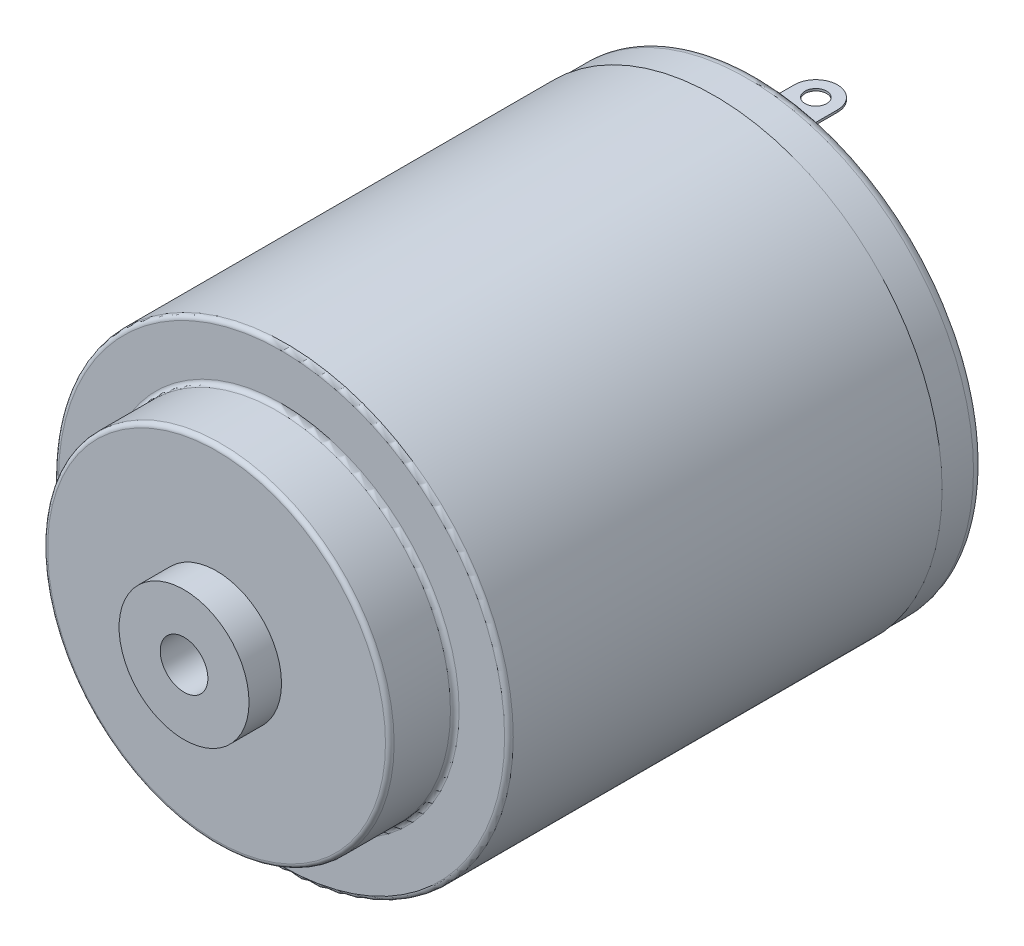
ISO-10303-21;
HEADER;
FILE_DESCRIPTION(('STEP AP214'),'2;1');
FILE_NAME('part.step','',(''),(''),'','','');
FILE_SCHEMA(('AUTOMOTIVE_DESIGN { 1 0 10303 214 1 1 1 1 }'));
ENDSEC;
DATA;
#1=APPLICATION_CONTEXT('core data for automotive mechanical design processes');
#2=APPLICATION_PROTOCOL_DEFINITION('international standard','automotive_design',2000,#1);
#3=PRODUCT_CONTEXT('',#1,'mechanical');
#4=PRODUCT('Part','Part','',(#3));
#5=PRODUCT_RELATED_PRODUCT_CATEGORY('part','',(#4));
#6=PRODUCT_DEFINITION_FORMATION('','',#4);
#7=PRODUCT_DEFINITION_CONTEXT('part definition',#1,'design');
#8=PRODUCT_DEFINITION('design','',#6,#7);
#9=PRODUCT_DEFINITION_SHAPE('','',#8);
#10=(LENGTH_UNIT() NAMED_UNIT(*) SI_UNIT(.MILLI.,.METRE.));
#11=(NAMED_UNIT(*) PLANE_ANGLE_UNIT() SI_UNIT($,.RADIAN.));
#12=(NAMED_UNIT(*) SI_UNIT($,.STERADIAN.) SOLID_ANGLE_UNIT());
#13=UNCERTAINTY_MEASURE_WITH_UNIT(LENGTH_MEASURE(1.E-05),#10,'distance_accuracy_value','');
#14=(GEOMETRIC_REPRESENTATION_CONTEXT(3) GLOBAL_UNCERTAINTY_ASSIGNED_CONTEXT((#13)) GLOBAL_UNIT_ASSIGNED_CONTEXT((#10,
#11,#12)) REPRESENTATION_CONTEXT('',''));
#15=CARTESIAN_POINT('',(0.,0.,0.));
#16=DIRECTION('',(0.,0.,1.));
#17=DIRECTION('',(1.,0.,0.));
#18=AXIS2_PLACEMENT_3D('',#15,#16,#17);
#19=CARTESIAN_POINT('',(0.,0.,-2.));
#20=DIRECTION('',(0.,0.,-1.));
#21=DIRECTION('',(-1.,0.,0.));
#22=AXIS2_PLACEMENT_3D('',#19,#20,#21);
#23=PLANE('',#22);
#24=DIRECTION('',(1.,0.,0.));
#25=VECTOR('',#24,1.);
#26=CARTESIAN_POINT('',(1.91816391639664,2.30665281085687,-2.));
#27=LINE('',#26,#25);
#28=CARTESIAN_POINT('',(-1.91816391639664,2.30665281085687,-2.));
#29=VERTEX_POINT('',#28);
#30=CARTESIAN_POINT('',(1.91816391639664,2.30665281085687,-2.));
#31=VERTEX_POINT('',#30);
#32=EDGE_CURVE('E233',#29,#31,#27,.T.);
#33=ORIENTED_EDGE('',*,*,#32,.F.);
#34=CARTESIAN_POINT('',(0.,0.,-2.));
#35=DIRECTION('',(0.,0.,-1.));
#36=DIRECTION('',(-1.,0.,0.));
#37=AXIS2_PLACEMENT_3D('',#34,#35,#36);
#38=CIRCLE('',#37,3.);
#39=EDGE_CURVE('E231',#31,#29,#38,.T.);
#40=ORIENTED_EDGE('',*,*,#39,.F.);
#41=EDGE_LOOP('',(#33,#40));
#42=FACE_BOUND('',#41,.T.);
#43=CARTESIAN_POINT('',(0.,0.,-2.));
#44=DIRECTION('',(0.,0.,-1.));
#45=DIRECTION('',(-1.,0.,0.));
#46=AXIS2_PLACEMENT_3D('',#43,#44,#45);
#47=CIRCLE('',#46,6.5);
#48=CARTESIAN_POINT('',(-1.75000000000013,-6.25999201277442,-2.));
#49=VERTEX_POINT('',#48);
#50=CARTESIAN_POINT('',(-1.75000000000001,6.25999201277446,-2.));
#51=VERTEX_POINT('',#50);
#52=EDGE_CURVE('E246',#49,#51,#47,.T.);
#53=ORIENTED_EDGE('',*,*,#52,.F.);
#54=DIRECTION('',(0.,-1.,0.));
#55=VECTOR('',#54,1.);
#56=CARTESIAN_POINT('',(-1.74999999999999,-3.03108891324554,-2.));
#57=LINE('',#56,#55);
#58=CARTESIAN_POINT('',(-1.74999999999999,-3.03108891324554,-2.));
#59=VERTEX_POINT('',#58);
#60=EDGE_CURVE('E254',#59,#49,#57,.T.);
#61=ORIENTED_EDGE('',*,*,#60,.F.);
#62=CARTESIAN_POINT('',(0.,0.,-2.));
#63=DIRECTION('',(0.,0.,1.));
#64=DIRECTION('',(-1.,0.,0.));
#65=AXIS2_PLACEMENT_3D('',#62,#63,#64);
#66=CIRCLE('',#65,3.5);
#67=CARTESIAN_POINT('',(-1.74999999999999,3.03108891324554,-2.));
#68=VERTEX_POINT('',#67);
#69=EDGE_CURVE('E251',#68,#59,#66,.T.);
#70=ORIENTED_EDGE('',*,*,#69,.F.);
#71=DIRECTION('',(0.,-1.,0.));
#72=VECTOR('',#71,1.);
#73=CARTESIAN_POINT('',(-1.75000000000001,6.25999201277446,-2.));
#74=LINE('',#73,#72);
#75=EDGE_CURVE('E248',#51,#68,#74,.T.);
#76=ORIENTED_EDGE('',*,*,#75,.F.);
#77=EDGE_LOOP('',(#53,#61,#70,#76));
#78=FACE_BOUND('',#77,.T.);
#79=CARTESIAN_POINT('',(0.,0.,-2.));
#80=DIRECTION('',(0.,0.,1.));
#81=DIRECTION('',(-1.,0.,0.));
#82=AXIS2_PLACEMENT_3D('',#79,#80,#81);
#83=CIRCLE('',#82,3.5);
#84=CARTESIAN_POINT('',(1.75,-3.03108891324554,-2.));
#85=VERTEX_POINT('',#84);
#86=CARTESIAN_POINT('',(1.75,3.03108891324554,-2.));
#87=VERTEX_POINT('',#86);
#88=EDGE_CURVE('E272',#85,#87,#83,.T.);
#89=ORIENTED_EDGE('',*,*,#88,.F.);
#90=DIRECTION('',(0.,1.,0.));
#91=VECTOR('',#90,1.);
#92=CARTESIAN_POINT('',(1.75,-3.03108891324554,-2.));
#93=LINE('',#92,#91);
#94=CARTESIAN_POINT('',(1.75,-6.25999201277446,-2.));
#95=VERTEX_POINT('',#94);
#96=EDGE_CURVE('E286',#95,#85,#93,.T.);
#97=ORIENTED_EDGE('',*,*,#96,.F.);
#98=CARTESIAN_POINT('',(0.,0.,-2.));
#99=DIRECTION('',(0.,0.,-1.));
#100=DIRECTION('',(-1.,0.,0.));
#101=AXIS2_PLACEMENT_3D('',#98,#99,#100);
#102=CIRCLE('',#101,6.5);
#103=CARTESIAN_POINT('',(1.75,6.25999201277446,-2.));
#104=VERTEX_POINT('',#103);
#105=EDGE_CURVE('E283',#104,#95,#102,.T.);
#106=ORIENTED_EDGE('',*,*,#105,.F.);
#107=DIRECTION('',(0.,1.,0.));
#108=VECTOR('',#107,1.);
#109=CARTESIAN_POINT('',(1.75,3.03108891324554,-2.));
#110=LINE('',#109,#108);
#111=EDGE_CURVE('E280',#87,#104,#110,.T.);
#112=ORIENTED_EDGE('',*,*,#111,.F.);
#113=EDGE_LOOP('',(#89,#97,#106,#112));
#114=FACE_BOUND('',#113,.T.);
#115=CARTESIAN_POINT('',(0.,0.,-2.));
#116=DIRECTION('',(0.,0.,-1.));
#117=DIRECTION('',(-1.,0.,0.));
#118=AXIS2_PLACEMENT_3D('',#115,#116,#117);
#119=CIRCLE('',#118,9.95);
#120=CARTESIAN_POINT('',(-9.95,0.,-2.));
#121=VERTEX_POINT('',#120);
#122=EDGE_CURVE('E340',#121,#121,#119,.T.);
#123=ORIENTED_EDGE('',*,*,#122,.T.);
#124=EDGE_LOOP('',(#123));
#125=FACE_BOUND('',#124,.T.);
#126=DIRECTION('',(1.,0.,0.));
#127=VECTOR('',#126,1.);
#128=CARTESIAN_POINT('',(0.,8.1,-2.));
#129=LINE('',#128,#127);
#130=CARTESIAN_POINT('',(-1.,8.1,-2.));
#131=VERTEX_POINT('',#130);
#132=CARTESIAN_POINT('',(0.999999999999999,8.1,-2.));
#133=VERTEX_POINT('',#132);
#134=EDGE_CURVE('E13',#131,#133,#129,.T.);
#135=ORIENTED_EDGE('',*,*,#134,.F.);
#136=DIRECTION('',(0.,-1.,0.));
#137=VECTOR('',#136,1.);
#138=CARTESIAN_POINT('',(-1.,0.,-2.));
#139=LINE('',#138,#137);
#140=CARTESIAN_POINT('',(-1.,8.,-2.));
#141=VERTEX_POINT('',#140);
#142=EDGE_CURVE('E349',#131,#141,#139,.T.);
#143=ORIENTED_EDGE('',*,*,#142,.T.);
#144=DIRECTION('',(1.,0.,0.));
#145=VECTOR('',#144,1.);
#146=CARTESIAN_POINT('',(0.,8.,-2.));
#147=LINE('',#146,#145);
#148=CARTESIAN_POINT('',(0.999999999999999,8.,-2.));
#149=VERTEX_POINT('',#148);
#150=EDGE_CURVE('E346',#141,#149,#147,.T.);
#151=ORIENTED_EDGE('',*,*,#150,.T.);
#152=DIRECTION('',(0.,1.,0.));
#153=VECTOR('',#152,1.);
#154=CARTESIAN_POINT('',(0.999999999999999,0.,-2.));
#155=LINE('',#154,#153);
#156=EDGE_CURVE('E47',#149,#133,#155,.T.);
#157=ORIENTED_EDGE('',*,*,#156,.T.);
#158=EDGE_LOOP('',(#135,#143,#151,#157));
#159=FACE_BOUND('',#158,.T.);
#160=DIRECTION('',(0.,-1.,0.));
#161=VECTOR('',#160,1.);
#162=CARTESIAN_POINT('',(0.999999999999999,-7.9,-2.));
#163=LINE('',#162,#161);
#164=CARTESIAN_POINT('',(0.999999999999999,-7.9,-2.));
#165=VERTEX_POINT('',#164);
#166=CARTESIAN_POINT('',(0.999999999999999,-8.,-2.));
#167=VERTEX_POINT('',#166);
#168=EDGE_CURVE('E60',#165,#167,#163,.T.);
#169=ORIENTED_EDGE('',*,*,#168,.F.);
#170=DIRECTION('',(1.,0.,0.));
#171=VECTOR('',#170,1.);
#172=CARTESIAN_POINT('',(-0.999999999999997,-7.9,-2.));
#173=LINE('',#172,#171);
#174=CARTESIAN_POINT('',(-0.999999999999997,-7.9,-2.));
#175=VERTEX_POINT('',#174);
#176=EDGE_CURVE('E55',#175,#165,#173,.T.);
#177=ORIENTED_EDGE('',*,*,#176,.F.);
#178=DIRECTION('',(0.,-1.,0.));
#179=VECTOR('',#178,1.);
#180=CARTESIAN_POINT('',(-0.999999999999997,-7.9,-2.));
#181=LINE('',#180,#179);
#182=CARTESIAN_POINT('',(-0.999999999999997,-8.,-2.));
#183=VERTEX_POINT('',#182);
#184=EDGE_CURVE('E160',#175,#183,#181,.T.);
#185=ORIENTED_EDGE('',*,*,#184,.T.);
#186=DIRECTION('',(1.,0.,0.));
#187=VECTOR('',#186,1.);
#188=CARTESIAN_POINT('',(-0.999999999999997,-8.,-2.));
#189=LINE('',#188,#187);
#190=EDGE_CURVE('E162',#183,#167,#189,.T.);
#191=ORIENTED_EDGE('',*,*,#190,.T.);
#192=EDGE_LOOP('',(#169,#177,#185,#191));
#193=FACE_BOUND('',#192,.T.);
#194=ADVANCED_FACE('F38',(#42,#78,#114,#125,#159,#193),#23,.T.);
#195=CARTESIAN_POINT('',(0.,0.,0.));
#196=DIRECTION('',(0.,0.,1.));
#197=DIRECTION('',(1.,0.,0.));
#198=AXIS2_PLACEMENT_3D('',#195,#196,#197);
#199=PLANE('',#198);
#200=CARTESIAN_POINT('',(0.,0.,0.));
#201=DIRECTION('',(0.,0.,1.));
#202=DIRECTION('',(1.,0.,0.));
#203=AXIS2_PLACEMENT_3D('',#200,#201,#202);
#204=CIRCLE('',#203,10.5);
#205=CARTESIAN_POINT('',(10.5,0.,0.));
#206=VERTEX_POINT('',#205);
#207=EDGE_CURVE('E316',#206,#206,#204,.T.);
#208=ORIENTED_EDGE('',*,*,#207,.F.);
#209=EDGE_LOOP('',(#208));
#210=FACE_BOUND('',#209,.T.);
#211=CARTESIAN_POINT('',(0.,0.,0.));
#212=DIRECTION('',(0.,0.,1.));
#213=DIRECTION('',(1.,0.,0.));
#214=AXIS2_PLACEMENT_3D('',#211,#212,#213);
#215=CIRCLE('',#214,10.45);
#216=CARTESIAN_POINT('',(10.45,0.,0.));
#217=VERTEX_POINT('',#216);
#218=EDGE_CURVE('E337',#217,#217,#215,.F.);
#219=ORIENTED_EDGE('',*,*,#218,.F.);
#220=EDGE_LOOP('',(#219));
#221=FACE_BOUND('',#220,.T.);
#222=ADVANCED_FACE('F372',(#210,#221),#199,.F.);
#223=CARTESIAN_POINT('',(0.,0.,23.));
#224=DIRECTION('',(0.,0.,1.));
#225=DIRECTION('',(1.,0.,0.));
#226=AXIS2_PLACEMENT_3D('',#223,#224,#225);
#227=PLANE('',#226);
#228=CARTESIAN_POINT('',(0.,0.,23.));
#229=DIRECTION('',(0.,0.,1.));
#230=DIRECTION('',(1.,0.,0.));
#231=AXIS2_PLACEMENT_3D('',#228,#229,#230);
#232=CIRCLE('',#231,7.8);
#233=CARTESIAN_POINT('',(7.8,0.,23.));
#234=VERTEX_POINT('',#233);
#235=EDGE_CURVE('E331',#234,#234,#232,.T.);
#236=ORIENTED_EDGE('',*,*,#235,.T.);
#237=EDGE_LOOP('',(#236));
#238=FACE_BOUND('',#237,.T.);
#239=CARTESIAN_POINT('',(0.,0.,23.));
#240=DIRECTION('',(0.,0.,1.));
#241=DIRECTION('',(1.,0.,0.));
#242=AXIS2_PLACEMENT_3D('',#239,#240,#241);
#243=CIRCLE('',#242,3.);
#244=CARTESIAN_POINT('',(3.,0.,23.));
#245=VERTEX_POINT('',#244);
#246=EDGE_CURVE('E304',#245,#245,#243,.T.);
#247=ORIENTED_EDGE('',*,*,#246,.F.);
#248=EDGE_LOOP('',(#247));
#249=FACE_BOUND('',#248,.T.);
#250=ADVANCED_FACE('F378',(#238,#249),#227,.T.);
#251=CARTESIAN_POINT('',(0.,0.,20.));
#252=DIRECTION('',(0.,0.,1.));
#253=DIRECTION('',(1.,0.,0.));
#254=AXIS2_PLACEMENT_3D('',#251,#252,#253);
#255=PLANE('',#254);
#256=CARTESIAN_POINT('',(0.,0.,20.));
#257=DIRECTION('',(0.,0.,1.));
#258=DIRECTION('',(1.,0.,0.));
#259=AXIS2_PLACEMENT_3D('',#256,#257,#258);
#260=CIRCLE('',#259,8.2);
#261=CARTESIAN_POINT('',(8.2,0.,20.));
#262=VERTEX_POINT('',#261);
#263=EDGE_CURVE('E328',#262,#262,#260,.F.);
#264=ORIENTED_EDGE('',*,*,#263,.T.);
#265=EDGE_LOOP('',(#264));
#266=FACE_BOUND('',#265,.T.);
#267=CARTESIAN_POINT('',(0.,0.,20.));
#268=DIRECTION('',(0.,0.,1.));
#269=DIRECTION('',(1.,0.,0.));
#270=AXIS2_PLACEMENT_3D('',#267,#268,#269);
#271=CIRCLE('',#270,10.3);
#272=CARTESIAN_POINT('',(10.3,0.,20.));
#273=VERTEX_POINT('',#272);
#274=EDGE_CURVE('E325',#273,#273,#271,.T.);
#275=ORIENTED_EDGE('',*,*,#274,.T.);
#276=EDGE_LOOP('',(#275));
#277=FACE_BOUND('',#276,.T.);
#278=ADVANCED_FACE('F414',(#266,#277),#255,.T.);
#279=CARTESIAN_POINT('',(0.,0.,20.));
#280=DIRECTION('',(0.,0.,-1.));
#281=DIRECTION('',(-1.,0.,0.));
#282=AXIS2_PLACEMENT_3D('',#279,#280,#281);
#283=CYLINDRICAL_SURFACE('',#282,10.5);
#284=CARTESIAN_POINT('',(0.,0.,19.8));
#285=DIRECTION('',(0.,0.,1.));
#286=DIRECTION('',(1.,0.,0.));
#287=AXIS2_PLACEMENT_3D('',#284,#285,#286);
#288=CIRCLE('',#287,10.5);
#289=CARTESIAN_POINT('',(10.5,0.,19.8));
#290=VERTEX_POINT('',#289);
#291=EDGE_CURVE('E334',#290,#290,#288,.F.);
#292=ORIENTED_EDGE('',*,*,#291,.T.);
#293=EDGE_LOOP('',(#292));
#294=FACE_BOUND('',#293,.T.);
#295=ORIENTED_EDGE('',*,*,#207,.T.);
#296=EDGE_LOOP('',(#295));
#297=FACE_BOUND('',#296,.T.);
#298=ADVANCED_FACE('F40',(#294,#297),#283,.T.);
#299=CARTESIAN_POINT('',(0.,0.,23.));
#300=DIRECTION('',(0.,0.,-1.));
#301=DIRECTION('',(-1.,0.,0.));
#302=AXIS2_PLACEMENT_3D('',#299,#300,#301);
#303=CYLINDRICAL_SURFACE('',#302,8.);
#304=CARTESIAN_POINT('',(0.,0.,20.2));
#305=DIRECTION('',(0.,0.,1.));
#306=DIRECTION('',(1.,0.,0.));
#307=AXIS2_PLACEMENT_3D('',#304,#305,#306);
#308=CIRCLE('',#307,8.);
#309=CARTESIAN_POINT('',(8.,0.,20.2));
#310=VERTEX_POINT('',#309);
#311=EDGE_CURVE('E322',#310,#310,#308,.T.);
#312=ORIENTED_EDGE('',*,*,#311,.T.);
#313=EDGE_LOOP('',(#312));
#314=FACE_BOUND('',#313,.T.);
#315=CARTESIAN_POINT('',(0.,0.,22.8));
#316=DIRECTION('',(0.,0.,1.));
#317=DIRECTION('',(1.,0.,0.));
#318=AXIS2_PLACEMENT_3D('',#315,#316,#317);
#319=CIRCLE('',#318,8.);
#320=CARTESIAN_POINT('',(8.,0.,22.8));
#321=VERTEX_POINT('',#320);
#322=EDGE_CURVE('E319',#321,#321,#319,.F.);
#323=ORIENTED_EDGE('',*,*,#322,.T.);
#324=EDGE_LOOP('',(#323));
#325=FACE_BOUND('',#324,.T.);
#326=ADVANCED_FACE('F410',(#314,#325),#303,.T.);
#327=CARTESIAN_POINT('',(0.,0.,24.5));
#328=DIRECTION('',(0.,0.,-1.));
#329=DIRECTION('',(-1.,0.,0.));
#330=AXIS2_PLACEMENT_3D('',#327,#328,#329);
#331=CYLINDRICAL_SURFACE('',#330,3.);
#332=CARTESIAN_POINT('',(0.,0.,24.5));
#333=DIRECTION('',(0.,0.,1.));
#334=DIRECTION('',(1.,0.,0.));
#335=AXIS2_PLACEMENT_3D('',#332,#333,#334);
#336=CIRCLE('',#335,3.);
#337=CARTESIAN_POINT('',(3.,0.,24.5));
#338=VERTEX_POINT('',#337);
#339=EDGE_CURVE('E313',#338,#338,#336,.T.);
#340=ORIENTED_EDGE('',*,*,#339,.F.);
#341=EDGE_LOOP('',(#340));
#342=FACE_BOUND('',#341,.T.);
#343=ORIENTED_EDGE('',*,*,#246,.T.);
#344=EDGE_LOOP('',(#343));
#345=FACE_BOUND('',#344,.T.);
#346=ADVANCED_FACE('F406',(#342,#345),#331,.T.);
#347=CARTESIAN_POINT('',(0.,0.,24.5));
#348=DIRECTION('',(0.,0.,1.));
#349=DIRECTION('',(1.,0.,0.));
#350=AXIS2_PLACEMENT_3D('',#347,#348,#349);
#351=PLANE('',#350);
#352=CARTESIAN_POINT('',(0.,0.,24.5));
#353=DIRECTION('',(0.,0.,1.));
#354=DIRECTION('',(1.,0.,0.));
#355=AXIS2_PLACEMENT_3D('',#352,#353,#354);
#356=CIRCLE('',#355,1.1);
#357=CARTESIAN_POINT('',(1.1,0.,24.5));
#358=VERTEX_POINT('',#357);
#359=EDGE_CURVE('E708',#358,#358,#356,.T.);
#360=ORIENTED_EDGE('',*,*,#359,.F.);
#361=EDGE_LOOP('',(#360));
#362=FACE_BOUND('',#361,.T.);
#363=ORIENTED_EDGE('',*,*,#339,.T.);
#364=EDGE_LOOP('',(#363));
#365=FACE_BOUND('',#364,.T.);
#366=ADVANCED_FACE('F402',(#362,#365),#351,.T.);
#367=CARTESIAN_POINT('',(0.,0.,20.2));
#368=DIRECTION('',(0.,0.,1.));
#369=DIRECTION('',(1.,0.,0.));
#370=AXIS2_PLACEMENT_3D('',#367,#368,#369);
#371=TOROIDAL_SURFACE('',#370,8.2,0.2);
#372=ORIENTED_EDGE('',*,*,#263,.F.);
#373=EDGE_LOOP('',(#372));
#374=FACE_BOUND('',#373,.T.);
#375=ORIENTED_EDGE('',*,*,#311,.F.);
#376=EDGE_LOOP('',(#375));
#377=FACE_BOUND('',#376,.T.);
#378=ADVANCED_FACE('F398',(#374,#377),#371,.F.);
#379=CARTESIAN_POINT('',(0.,0.,22.8));
#380=DIRECTION('',(0.,0.,1.));
#381=DIRECTION('',(1.,0.,0.));
#382=AXIS2_PLACEMENT_3D('',#379,#380,#381);
#383=TOROIDAL_SURFACE('',#382,7.8,0.2);
#384=ORIENTED_EDGE('',*,*,#322,.F.);
#385=EDGE_LOOP('',(#384));
#386=FACE_BOUND('',#385,.T.);
#387=ORIENTED_EDGE('',*,*,#235,.F.);
#388=EDGE_LOOP('',(#387));
#389=FACE_BOUND('',#388,.T.);
#390=ADVANCED_FACE('F394',(#386,#389),#383,.T.);
#391=CARTESIAN_POINT('',(0.,0.,19.8));
#392=DIRECTION('',(0.,0.,1.));
#393=DIRECTION('',(1.,0.,0.));
#394=AXIS2_PLACEMENT_3D('',#391,#392,#393);
#395=TOROIDAL_SURFACE('',#394,10.3,0.2);
#396=ORIENTED_EDGE('',*,*,#291,.F.);
#397=EDGE_LOOP('',(#396));
#398=FACE_BOUND('',#397,.T.);
#399=ORIENTED_EDGE('',*,*,#274,.F.);
#400=EDGE_LOOP('',(#399));
#401=FACE_BOUND('',#400,.T.);
#402=ADVANCED_FACE('F390',(#398,#401),#395,.T.);
#403=CARTESIAN_POINT('',(0.,0.,-2.));
#404=DIRECTION('',(0.,0.,1.));
#405=DIRECTION('',(1.,0.,0.));
#406=AXIS2_PLACEMENT_3D('',#403,#404,#405);
#407=CYLINDRICAL_SURFACE('',#406,10.45);
#408=CARTESIAN_POINT('',(0.,0.,-1.5));
#409=DIRECTION('',(0.,0.,-1.));
#410=DIRECTION('',(-1.,0.,0.));
#411=AXIS2_PLACEMENT_3D('',#408,#409,#410);
#412=CIRCLE('',#411,10.45);
#413=CARTESIAN_POINT('',(-10.45,0.,-1.5));
#414=VERTEX_POINT('',#413);
#415=EDGE_CURVE('E343',#414,#414,#412,.F.);
#416=ORIENTED_EDGE('',*,*,#415,.T.);
#417=EDGE_LOOP('',(#416));
#418=FACE_BOUND('',#417,.T.);
#419=ORIENTED_EDGE('',*,*,#218,.T.);
#420=EDGE_LOOP('',(#419));
#421=FACE_BOUND('',#420,.T.);
#422=ADVANCED_FACE('F387',(#418,#421),#407,.T.);
#423=CARTESIAN_POINT('',(0.,0.,-1.5));
#424=DIRECTION('',(0.,0.,-1.));
#425=DIRECTION('',(-1.,0.,0.));
#426=AXIS2_PLACEMENT_3D('',#423,#424,#425);
#427=TOROIDAL_SURFACE('',#426,9.95,0.5);
#428=ORIENTED_EDGE('',*,*,#415,.F.);
#429=EDGE_LOOP('',(#428));
#430=FACE_BOUND('',#429,.T.);
#431=ORIENTED_EDGE('',*,*,#122,.F.);
#432=EDGE_LOOP('',(#431));
#433=FACE_BOUND('',#432,.T.);
#434=ADVANCED_FACE('F385',(#430,#433),#427,.T.);
#435=CARTESIAN_POINT('',(0.,0.,-1.5));
#436=DIRECTION('',(0.,0.,-1.));
#437=DIRECTION('',(-1.,0.,0.));
#438=AXIS2_PLACEMENT_3D('',#435,#436,#437);
#439=CYLINDRICAL_SURFACE('',#438,3.5);
#440=ORIENTED_EDGE('',*,*,#88,.T.);
#441=DIRECTION('',(0.,0.,-1.));
#442=VECTOR('',#441,1.);
#443=CARTESIAN_POINT('',(1.75,3.03108891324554,-1.5));
#444=LINE('',#443,#442);
#445=CARTESIAN_POINT('',(1.75,3.03108891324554,-1.5));
#446=VERTEX_POINT('',#445);
#447=EDGE_CURVE('E301',#446,#87,#444,.T.);
#448=ORIENTED_EDGE('',*,*,#447,.F.);
#449=CARTESIAN_POINT('',(0.,0.,-1.5));
#450=DIRECTION('',(0.,0.,1.));
#451=DIRECTION('',(-1.,0.,0.));
#452=AXIS2_PLACEMENT_3D('',#449,#450,#451);
#453=CIRCLE('',#452,3.5);
#454=CARTESIAN_POINT('',(1.75,-3.03108891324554,-1.5));
#455=VERTEX_POINT('',#454);
#456=EDGE_CURVE('E289',#455,#446,#453,.T.);
#457=ORIENTED_EDGE('',*,*,#456,.F.);
#458=DIRECTION('',(0.,0.,-1.));
#459=VECTOR('',#458,1.);
#460=CARTESIAN_POINT('',(1.75,-3.03108891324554,-1.5));
#461=LINE('',#460,#459);
#462=EDGE_CURVE('E302',#455,#85,#461,.T.);
#463=ORIENTED_EDGE('',*,*,#462,.T.);
#464=EDGE_LOOP('',(#440,#448,#457,#463));
#465=FACE_BOUND('',#464,.T.);
#466=ADVANCED_FACE('F477',(#465),#439,.T.);
#467=CARTESIAN_POINT('',(1.75,-3.03108891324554,-1.5));
#468=DIRECTION('',(-1.,0.,0.));
#469=DIRECTION('',(0.,0.,1.));
#470=AXIS2_PLACEMENT_3D('',#467,#468,#469);
#471=PLANE('',#470);
#472=ORIENTED_EDGE('',*,*,#96,.T.);
#473=ORIENTED_EDGE('',*,*,#462,.F.);
#474=DIRECTION('',(0.,1.,0.));
#475=VECTOR('',#474,1.);
#476=CARTESIAN_POINT('',(1.75,-3.03108891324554,-1.5));
#477=LINE('',#476,#475);
#478=CARTESIAN_POINT('',(1.75,-6.25999201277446,-1.5));
#479=VERTEX_POINT('',#478);
#480=EDGE_CURVE('E298',#479,#455,#477,.T.);
#481=ORIENTED_EDGE('',*,*,#480,.F.);
#482=DIRECTION('',(0.,0.,-1.));
#483=VECTOR('',#482,1.);
#484=CARTESIAN_POINT('',(1.75,-6.25999201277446,-1.5));
#485=LINE('',#484,#483);
#486=EDGE_CURVE('E305',#479,#95,#485,.T.);
#487=ORIENTED_EDGE('',*,*,#486,.T.);
#488=EDGE_LOOP('',(#472,#473,#481,#487));
#489=FACE_BOUND('',#488,.T.);
#490=ADVANCED_FACE('F484',(#489),#471,.F.);
#491=CARTESIAN_POINT('',(0.,0.,-1.5));
#492=DIRECTION('',(0.,0.,-1.));
#493=DIRECTION('',(-1.,0.,0.));
#494=AXIS2_PLACEMENT_3D('',#491,#492,#493);
#495=CYLINDRICAL_SURFACE('',#494,6.5);
#496=ORIENTED_EDGE('',*,*,#105,.T.);
#497=ORIENTED_EDGE('',*,*,#486,.F.);
#498=CARTESIAN_POINT('',(0.,0.,-1.5));
#499=DIRECTION('',(0.,0.,-1.));
#500=DIRECTION('',(-1.,0.,0.));
#501=AXIS2_PLACEMENT_3D('',#498,#499,#500);
#502=CIRCLE('',#501,6.5);
#503=CARTESIAN_POINT('',(1.75,6.25999201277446,-1.5));
#504=VERTEX_POINT('',#503);
#505=EDGE_CURVE('E295',#504,#479,#502,.T.);
#506=ORIENTED_EDGE('',*,*,#505,.F.);
#507=DIRECTION('',(0.,0.,-1.));
#508=VECTOR('',#507,1.);
#509=CARTESIAN_POINT('',(1.75,6.25999201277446,-1.5));
#510=LINE('',#509,#508);
#511=EDGE_CURVE('E307',#504,#104,#510,.T.);
#512=ORIENTED_EDGE('',*,*,#511,.T.);
#513=EDGE_LOOP('',(#496,#497,#506,#512));
#514=FACE_BOUND('',#513,.T.);
#515=ADVANCED_FACE('F491',(#514),#495,.F.);
#516=CARTESIAN_POINT('',(1.75,3.03108891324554,-1.5));
#517=DIRECTION('',(-1.,0.,0.));
#518=DIRECTION('',(0.,0.,1.));
#519=AXIS2_PLACEMENT_3D('',#516,#517,#518);
#520=PLANE('',#519);
#521=ORIENTED_EDGE('',*,*,#111,.T.);
#522=ORIENTED_EDGE('',*,*,#511,.F.);
#523=DIRECTION('',(0.,1.,0.));
#524=VECTOR('',#523,1.);
#525=CARTESIAN_POINT('',(1.75,3.03108891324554,-1.5));
#526=LINE('',#525,#524);
#527=EDGE_CURVE('E292',#446,#504,#526,.T.);
#528=ORIENTED_EDGE('',*,*,#527,.F.);
#529=ORIENTED_EDGE('',*,*,#447,.T.);
#530=EDGE_LOOP('',(#521,#522,#528,#529));
#531=FACE_BOUND('',#530,.T.);
#532=ADVANCED_FACE('F499',(#531),#520,.F.);
#533=CARTESIAN_POINT('',(0.,0.,-1.5));
#534=DIRECTION('',(0.,0.,-1.));
#535=DIRECTION('',(-1.,0.,0.));
#536=AXIS2_PLACEMENT_3D('',#533,#534,#535);
#537=PLANE('',#536);
#538=ORIENTED_EDGE('',*,*,#456,.T.);
#539=ORIENTED_EDGE('',*,*,#527,.T.);
#540=ORIENTED_EDGE('',*,*,#505,.T.);
#541=ORIENTED_EDGE('',*,*,#480,.T.);
#542=EDGE_LOOP('',(#538,#539,#540,#541));
#543=FACE_BOUND('',#542,.T.);
#544=ADVANCED_FACE('F507',(#543),#537,.T.);
#545=CARTESIAN_POINT('',(0.,0.,-1.5));
#546=DIRECTION('',(0.,0.,-1.));
#547=DIRECTION('',(-1.,0.,0.));
#548=AXIS2_PLACEMENT_3D('',#545,#546,#547);
#549=CYLINDRICAL_SURFACE('',#548,6.5);
#550=ORIENTED_EDGE('',*,*,#52,.T.);
#551=DIRECTION('',(0.,0.,-1.));
#552=VECTOR('',#551,1.);
#553=CARTESIAN_POINT('',(-1.75000000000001,6.25999201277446,-1.5));
#554=LINE('',#553,#552);
#555=CARTESIAN_POINT('',(-1.75000000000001,6.25999201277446,-1.5));
#556=VERTEX_POINT('',#555);
#557=EDGE_CURVE('E269',#556,#51,#554,.T.);
#558=ORIENTED_EDGE('',*,*,#557,.F.);
#559=CARTESIAN_POINT('',(0.,0.,-1.5));
#560=DIRECTION('',(0.,0.,-1.));
#561=DIRECTION('',(-1.,0.,0.));
#562=AXIS2_PLACEMENT_3D('',#559,#560,#561);
#563=CIRCLE('',#562,6.5);
#564=CARTESIAN_POINT('',(-1.75000000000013,-6.25999201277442,-1.5));
#565=VERTEX_POINT('',#564);
#566=EDGE_CURVE('E257',#565,#556,#563,.T.);
#567=ORIENTED_EDGE('',*,*,#566,.F.);
#568=DIRECTION('',(0.,0.,-1.));
#569=VECTOR('',#568,1.);
#570=CARTESIAN_POINT('',(-1.75000000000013,-6.25999201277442,-1.5));
#571=LINE('',#570,#569);
#572=EDGE_CURVE('E270',#565,#49,#571,.T.);
#573=ORIENTED_EDGE('',*,*,#572,.T.);
#574=EDGE_LOOP('',(#550,#558,#567,#573));
#575=FACE_BOUND('',#574,.T.);
#576=ADVANCED_FACE('F515',(#575),#549,.F.);
#577=CARTESIAN_POINT('',(-1.74999999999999,-3.03108891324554,-1.5));
#578=DIRECTION('',(1.,0.,0.));
#579=DIRECTION('',(0.,1.,0.));
#580=AXIS2_PLACEMENT_3D('',#577,#578,#579);
#581=PLANE('',#580);
#582=ORIENTED_EDGE('',*,*,#60,.T.);
#583=ORIENTED_EDGE('',*,*,#572,.F.);
#584=DIRECTION('',(0.,-1.,0.));
#585=VECTOR('',#584,1.);
#586=CARTESIAN_POINT('',(-1.74999999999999,-3.03108891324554,-1.5));
#587=LINE('',#586,#585);
#588=CARTESIAN_POINT('',(-1.74999999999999,-3.03108891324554,-1.5));
#589=VERTEX_POINT('',#588);
#590=EDGE_CURVE('E266',#589,#565,#587,.T.);
#591=ORIENTED_EDGE('',*,*,#590,.F.);
#592=DIRECTION('',(0.,0.,-1.));
#593=VECTOR('',#592,1.);
#594=CARTESIAN_POINT('',(-1.74999999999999,-3.03108891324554,-1.5));
#595=LINE('',#594,#593);
#596=EDGE_CURVE('E273',#589,#59,#595,.T.);
#597=ORIENTED_EDGE('',*,*,#596,.T.);
#598=EDGE_LOOP('',(#582,#583,#591,#597));
#599=FACE_BOUND('',#598,.T.);
#600=ADVANCED_FACE('F523',(#599),#581,.F.);
#601=CARTESIAN_POINT('',(0.,0.,-1.5));
#602=DIRECTION('',(0.,0.,-1.));
#603=DIRECTION('',(-1.,0.,0.));
#604=AXIS2_PLACEMENT_3D('',#601,#602,#603);
#605=CYLINDRICAL_SURFACE('',#604,3.5);
#606=ORIENTED_EDGE('',*,*,#69,.T.);
#607=ORIENTED_EDGE('',*,*,#596,.F.);
#608=CARTESIAN_POINT('',(0.,0.,-1.5));
#609=DIRECTION('',(0.,0.,1.));
#610=DIRECTION('',(-1.,0.,0.));
#611=AXIS2_PLACEMENT_3D('',#608,#609,#610);
#612=CIRCLE('',#611,3.5);
#613=CARTESIAN_POINT('',(-1.74999999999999,3.03108891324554,-1.5));
#614=VERTEX_POINT('',#613);
#615=EDGE_CURVE('E263',#614,#589,#612,.T.);
#616=ORIENTED_EDGE('',*,*,#615,.F.);
#617=DIRECTION('',(0.,0.,-1.));
#618=VECTOR('',#617,1.);
#619=CARTESIAN_POINT('',(-1.74999999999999,3.03108891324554,-1.5));
#620=LINE('',#619,#618);
#621=EDGE_CURVE('E275',#614,#68,#620,.T.);
#622=ORIENTED_EDGE('',*,*,#621,.T.);
#623=EDGE_LOOP('',(#606,#607,#616,#622));
#624=FACE_BOUND('',#623,.T.);
#625=ADVANCED_FACE('F531',(#624),#605,.T.);
#626=CARTESIAN_POINT('',(-1.75000000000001,6.25999201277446,-1.5));
#627=DIRECTION('',(1.,0.,0.));
#628=DIRECTION('',(0.,1.,0.));
#629=AXIS2_PLACEMENT_3D('',#626,#627,#628);
#630=PLANE('',#629);
#631=ORIENTED_EDGE('',*,*,#75,.T.);
#632=ORIENTED_EDGE('',*,*,#621,.F.);
#633=DIRECTION('',(0.,-1.,0.));
#634=VECTOR('',#633,1.);
#635=CARTESIAN_POINT('',(-1.75000000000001,6.25999201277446,-1.5));
#636=LINE('',#635,#634);
#637=EDGE_CURVE('E260',#556,#614,#636,.T.);
#638=ORIENTED_EDGE('',*,*,#637,.F.);
#639=ORIENTED_EDGE('',*,*,#557,.T.);
#640=EDGE_LOOP('',(#631,#632,#638,#639));
#641=FACE_BOUND('',#640,.T.);
#642=ADVANCED_FACE('F539',(#641),#630,.F.);
#643=CARTESIAN_POINT('',(0.,0.,-1.5));
#644=DIRECTION('',(0.,0.,-1.));
#645=DIRECTION('',(-1.,0.,0.));
#646=AXIS2_PLACEMENT_3D('',#643,#644,#645);
#647=PLANE('',#646);
#648=ORIENTED_EDGE('',*,*,#566,.T.);
#649=ORIENTED_EDGE('',*,*,#637,.T.);
#650=ORIENTED_EDGE('',*,*,#615,.T.);
#651=ORIENTED_EDGE('',*,*,#590,.T.);
#652=EDGE_LOOP('',(#648,#649,#650,#651));
#653=FACE_BOUND('',#652,.T.);
#654=ADVANCED_FACE('F547',(#653),#647,.T.);
#655=CARTESIAN_POINT('',(0.,0.,-4.));
#656=DIRECTION('',(0.,0.,1.));
#657=DIRECTION('',(1.,0.,0.));
#658=AXIS2_PLACEMENT_3D('',#655,#656,#657);
#659=CYLINDRICAL_SURFACE('',#658,3.);
#660=ORIENTED_EDGE('',*,*,#39,.T.);
#661=DIRECTION('',(0.,0.,1.));
#662=VECTOR('',#661,1.);
#663=CARTESIAN_POINT('',(-1.91816391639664,2.30665281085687,-4.));
#664=LINE('',#663,#662);
#665=CARTESIAN_POINT('',(-1.91816391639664,2.30665281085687,-4.));
#666=VERTEX_POINT('',#665);
#667=EDGE_CURVE('E243',#666,#29,#664,.T.);
#668=ORIENTED_EDGE('',*,*,#667,.F.);
#669=CARTESIAN_POINT('',(0.,0.,-4.));
#670=DIRECTION('',(0.,0.,-1.));
#671=DIRECTION('',(-1.,0.,0.));
#672=AXIS2_PLACEMENT_3D('',#669,#670,#671);
#673=CIRCLE('',#672,3.);
#674=CARTESIAN_POINT('',(1.91816391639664,2.30665281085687,-4.));
#675=VERTEX_POINT('',#674);
#676=EDGE_CURVE('E235',#675,#666,#673,.T.);
#677=ORIENTED_EDGE('',*,*,#676,.F.);
#678=DIRECTION('',(0.,0.,1.));
#679=VECTOR('',#678,1.);
#680=CARTESIAN_POINT('',(1.91816391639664,2.30665281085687,-4.));
#681=LINE('',#680,#679);
#682=EDGE_CURVE('E240',#675,#31,#681,.T.);
#683=ORIENTED_EDGE('',*,*,#682,.T.);
#684=EDGE_LOOP('',(#660,#668,#677,#683));
#685=FACE_BOUND('',#684,.T.);
#686=ADVANCED_FACE('F555',(#685),#659,.T.);
#687=CARTESIAN_POINT('',(1.91816391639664,2.30665281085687,-4.));
#688=DIRECTION('',(0.,-1.,0.));
#689=DIRECTION('',(0.,0.,-1.));
#690=AXIS2_PLACEMENT_3D('',#687,#688,#689);
#691=PLANE('',#690);
#692=ORIENTED_EDGE('',*,*,#32,.T.);
#693=ORIENTED_EDGE('',*,*,#682,.F.);
#694=DIRECTION('',(1.,0.,0.));
#695=VECTOR('',#694,1.);
#696=CARTESIAN_POINT('',(1.91816391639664,2.30665281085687,-4.));
#697=LINE('',#696,#695);
#698=EDGE_CURVE('E238',#666,#675,#697,.T.);
#699=ORIENTED_EDGE('',*,*,#698,.F.);
#700=ORIENTED_EDGE('',*,*,#667,.T.);
#701=EDGE_LOOP('',(#692,#693,#699,#700));
#702=FACE_BOUND('',#701,.T.);
#703=ADVANCED_FACE('F563',(#702),#691,.F.);
#704=CARTESIAN_POINT('',(0.,0.,-4.));
#705=DIRECTION('',(0.,0.,-1.));
#706=DIRECTION('',(-1.,0.,0.));
#707=AXIS2_PLACEMENT_3D('',#704,#705,#706);
#708=PLANE('',#707);
#709=CARTESIAN_POINT('',(0.,0.,-4.));
#710=DIRECTION('',(0.,0.,-1.));
#711=DIRECTION('',(-1.,0.,0.));
#712=AXIS2_PLACEMENT_3D('',#709,#710,#711);
#713=CIRCLE('',#712,1.5);
#714=CARTESIAN_POINT('',(-1.5,0.,-4.));
#715=VERTEX_POINT('',#714);
#716=EDGE_CURVE('E225',#715,#715,#713,.T.);
#717=ORIENTED_EDGE('',*,*,#716,.F.);
#718=EDGE_LOOP('',(#717));
#719=FACE_BOUND('',#718,.T.);
#720=ORIENTED_EDGE('',*,*,#676,.T.);
#721=ORIENTED_EDGE('',*,*,#698,.T.);
#722=EDGE_LOOP('',(#720,#721));
#723=FACE_BOUND('',#722,.T.);
#724=ADVANCED_FACE('F571',(#719,#723),#708,.T.);
#725=CARTESIAN_POINT('',(0.,0.,-3.));
#726=DIRECTION('',(0.,0.,-1.));
#727=DIRECTION('',(-1.,0.,0.));
#728=AXIS2_PLACEMENT_3D('',#725,#726,#727);
#729=CYLINDRICAL_SURFACE('',#728,1.5);
#730=CARTESIAN_POINT('',(0.,0.,-3.));
#731=DIRECTION('',(0.,0.,-1.));
#732=DIRECTION('',(-1.,0.,0.));
#733=AXIS2_PLACEMENT_3D('',#730,#731,#732);
#734=CIRCLE('',#733,1.5);
#735=CARTESIAN_POINT('',(-1.5,0.,-3.));
#736=VERTEX_POINT('',#735);
#737=EDGE_CURVE('E228',#736,#736,#734,.T.);
#738=ORIENTED_EDGE('',*,*,#737,.F.);
#739=EDGE_LOOP('',(#738));
#740=FACE_BOUND('',#739,.T.);
#741=ORIENTED_EDGE('',*,*,#716,.T.);
#742=EDGE_LOOP('',(#741));
#743=FACE_BOUND('',#742,.T.);
#744=ADVANCED_FACE('F579',(#740,#743),#729,.F.);
#745=CARTESIAN_POINT('',(0.,0.,-3.));
#746=DIRECTION('',(0.,0.,-1.));
#747=DIRECTION('',(-1.,0.,0.));
#748=AXIS2_PLACEMENT_3D('',#745,#746,#747);
#749=PLANE('',#748);
#750=CARTESIAN_POINT('',(0.,0.,-3.));
#751=DIRECTION('',(0.,0.,-1.));
#752=DIRECTION('',(-1.,0.,0.));
#753=AXIS2_PLACEMENT_3D('',#750,#751,#752);
#754=CIRCLE('',#753,1.1);
#755=CARTESIAN_POINT('',(-1.1,0.,-3.));
#756=VERTEX_POINT('',#755);
#757=EDGE_CURVE('E42',#756,#756,#754,.T.);
#758=ORIENTED_EDGE('',*,*,#757,.F.);
#759=EDGE_LOOP('',(#758));
#760=FACE_BOUND('',#759,.T.);
#761=ORIENTED_EDGE('',*,*,#737,.T.);
#762=EDGE_LOOP('',(#761));
#763=FACE_BOUND('',#762,.T.);
#764=ADVANCED_FACE('F587',(#760,#763),#749,.T.);
#765=CARTESIAN_POINT('',(0.999999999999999,8.1,-0.935861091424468));
#766=DIRECTION('',(-1.,0.,0.));
#767=DIRECTION('',(0.,0.,1.));
#768=AXIS2_PLACEMENT_3D('',#765,#766,#767);
#769=PLANE('',#768);
#770=ORIENTED_EDGE('',*,*,#156,.F.);
#771=DIRECTION('',(0.,0.,-1.));
#772=VECTOR('',#771,1.);
#773=CARTESIAN_POINT('',(0.999999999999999,8.,-0.935861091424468));
#774=LINE('',#773,#772);
#775=CARTESIAN_POINT('',(0.999999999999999,8.,-4.67095834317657));
#776=VERTEX_POINT('',#775);
#777=EDGE_CURVE('E205',#149,#776,#774,.T.);
#778=ORIENTED_EDGE('',*,*,#777,.T.);
#779=DIRECTION('',(0.,-1.,0.));
#780=VECTOR('',#779,1.);
#781=CARTESIAN_POINT('',(0.999999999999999,8.1,-4.67095834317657));
#782=LINE('',#781,#780);
#783=CARTESIAN_POINT('',(0.999999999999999,8.1,-4.67095834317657));
#784=VERTEX_POINT('',#783);
#785=EDGE_CURVE('E222',#784,#776,#782,.T.);
#786=ORIENTED_EDGE('',*,*,#785,.F.);
#787=DIRECTION('',(0.,0.,-1.));
#788=VECTOR('',#787,1.);
#789=CARTESIAN_POINT('',(0.999999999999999,8.1,-0.935861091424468));
#790=LINE('',#789,#788);
#791=EDGE_CURVE('E212',#133,#784,#790,.T.);
#792=ORIENTED_EDGE('',*,*,#791,.F.);
#793=EDGE_LOOP('',(#770,#778,#786,#792));
#794=FACE_BOUND('',#793,.T.);
#795=ADVANCED_FACE('F593',(#794),#769,.F.);
#796=CARTESIAN_POINT('',(0.,8.1,-4.67095834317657));
#797=DIRECTION('',(0.,-1.,0.));
#798=DIRECTION('',(0.,0.,-1.));
#799=AXIS2_PLACEMENT_3D('',#796,#797,#798);
#800=CYLINDRICAL_SURFACE('',#799,1.);
#801=CARTESIAN_POINT('',(0.,8.,-4.67095834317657));
#802=DIRECTION('',(0.,1.,0.));
#803=DIRECTION('',(0.,0.,1.));
#804=AXIS2_PLACEMENT_3D('',#801,#802,#803);
#805=CIRCLE('',#804,1.);
#806=CARTESIAN_POINT('',(-1.,8.,-4.67095834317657));
#807=VERTEX_POINT('',#806);
#808=EDGE_CURVE('E207',#776,#807,#805,.T.);
#809=ORIENTED_EDGE('',*,*,#808,.T.);
#810=DIRECTION('',(0.,-1.,0.));
#811=VECTOR('',#810,1.);
#812=CARTESIAN_POINT('',(-1.,8.1,-4.67095834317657));
#813=LINE('',#812,#811);
#814=CARTESIAN_POINT('',(-1.,8.1,-4.67095834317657));
#815=VERTEX_POINT('',#814);
#816=EDGE_CURVE('E219',#815,#807,#813,.T.);
#817=ORIENTED_EDGE('',*,*,#816,.F.);
#818=CARTESIAN_POINT('',(0.,8.1,-4.67095834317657));
#819=DIRECTION('',(0.,1.,0.));
#820=DIRECTION('',(0.,0.,1.));
#821=AXIS2_PLACEMENT_3D('',#818,#819,#820);
#822=CIRCLE('',#821,1.);
#823=EDGE_CURVE('E214',#784,#815,#822,.T.);
#824=ORIENTED_EDGE('',*,*,#823,.F.);
#825=ORIENTED_EDGE('',*,*,#785,.T.);
#826=EDGE_LOOP('',(#809,#817,#824,#825));
#827=FACE_BOUND('',#826,.T.);
#828=ADVANCED_FACE('F597',(#827),#800,.T.);
#829=CARTESIAN_POINT('',(-1.,8.1,-0.935861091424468));
#830=DIRECTION('',(1.,0.,0.));
#831=DIRECTION('',(0.,0.,-1.));
#832=AXIS2_PLACEMENT_3D('',#829,#830,#831);
#833=PLANE('',#832);
#834=ORIENTED_EDGE('',*,*,#142,.F.);
#835=DIRECTION('',(0.,0.,1.));
#836=VECTOR('',#835,1.);
#837=CARTESIAN_POINT('',(-1.,8.1,-0.935861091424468));
#838=LINE('',#837,#836);
#839=EDGE_CURVE('E216',#815,#131,#838,.T.);
#840=ORIENTED_EDGE('',*,*,#839,.F.);
#841=ORIENTED_EDGE('',*,*,#816,.T.);
#842=DIRECTION('',(0.,0.,1.));
#843=VECTOR('',#842,1.);
#844=CARTESIAN_POINT('',(-1.,8.,-0.935861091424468));
#845=LINE('',#844,#843);
#846=EDGE_CURVE('E209',#807,#141,#845,.T.);
#847=ORIENTED_EDGE('',*,*,#846,.T.);
#848=EDGE_LOOP('',(#834,#840,#841,#847));
#849=FACE_BOUND('',#848,.T.);
#850=ADVANCED_FACE('F605',(#849),#833,.F.);
#851=CARTESIAN_POINT('',(0.,8.1,-4.67095834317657));
#852=DIRECTION('',(0.,1.,0.));
#853=DIRECTION('',(0.,0.,1.));
#854=AXIS2_PLACEMENT_3D('',#851,#852,#853);
#855=PLANE('',#854);
#856=CARTESIAN_POINT('',(0.,8.1,-4.67095834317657));
#857=DIRECTION('',(0.,1.,0.));
#858=DIRECTION('',(0.,0.,1.));
#859=AXIS2_PLACEMENT_3D('',#856,#857,#858);
#860=CIRCLE('',#859,0.5);
#861=CARTESIAN_POINT('',(0.,8.1,-4.17095834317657));
#862=VERTEX_POINT('',#861);
#863=EDGE_CURVE('E166',#862,#862,#860,.T.);
#864=ORIENTED_EDGE('',*,*,#863,.F.);
#865=EDGE_LOOP('',(#864));
#866=FACE_BOUND('',#865,.T.);
#867=ORIENTED_EDGE('',*,*,#839,.T.);
#868=ORIENTED_EDGE('',*,*,#134,.T.);
#869=ORIENTED_EDGE('',*,*,#791,.T.);
#870=ORIENTED_EDGE('',*,*,#823,.T.);
#871=EDGE_LOOP('',(#867,#868,#869,#870));
#872=FACE_BOUND('',#871,.T.);
#873=ADVANCED_FACE('F370',(#866,#872),#855,.T.);
#874=CARTESIAN_POINT('',(0.,8.,-4.67095834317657));
#875=DIRECTION('',(0.,1.,0.));
#876=DIRECTION('',(0.,0.,1.));
#877=AXIS2_PLACEMENT_3D('',#874,#875,#876);
#878=PLANE('',#877);
#879=CARTESIAN_POINT('',(0.,8.,-4.67095834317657));
#880=DIRECTION('',(0.,1.,0.));
#881=DIRECTION('',(0.,0.,1.));
#882=AXIS2_PLACEMENT_3D('',#879,#880,#881);
#883=CIRCLE('',#882,0.5);
#884=CARTESIAN_POINT('',(0.,8.,-4.17095834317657));
#885=VERTEX_POINT('',#884);
#886=EDGE_CURVE('E204',#885,#885,#883,.T.);
#887=ORIENTED_EDGE('',*,*,#886,.T.);
#888=EDGE_LOOP('',(#887));
#889=FACE_BOUND('',#888,.T.);
#890=ORIENTED_EDGE('',*,*,#150,.F.);
#891=ORIENTED_EDGE('',*,*,#846,.F.);
#892=ORIENTED_EDGE('',*,*,#808,.F.);
#893=ORIENTED_EDGE('',*,*,#777,.F.);
#894=EDGE_LOOP('',(#890,#891,#892,#893));
#895=FACE_BOUND('',#894,.T.);
#896=ADVANCED_FACE('F356',(#889,#895),#878,.F.);
#897=CARTESIAN_POINT('',(0.,-10.5,-4.67095834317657));
#898=DIRECTION('',(0.,1.,0.));
#899=DIRECTION('',(0.,0.,1.));
#900=AXIS2_PLACEMENT_3D('',#897,#898,#899);
#901=CYLINDRICAL_SURFACE('',#900,0.5);
#902=ORIENTED_EDGE('',*,*,#863,.T.);
#903=EDGE_LOOP('',(#902));
#904=FACE_BOUND('',#903,.T.);
#905=ORIENTED_EDGE('',*,*,#886,.F.);
#906=EDGE_LOOP('',(#905));
#907=FACE_BOUND('',#906,.T.);
#908=ADVANCED_FACE('F359',(#904,#907),#901,.F.);
#909=CARTESIAN_POINT('',(-0.999999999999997,-7.9,-2.));
#910=DIRECTION('',(1.,0.,0.));
#911=DIRECTION('',(0.,0.,-1.));
#912=AXIS2_PLACEMENT_3D('',#909,#910,#911);
#913=PLANE('',#912);
#914=DIRECTION('',(0.,0.,1.));
#915=VECTOR('',#914,1.);
#916=CARTESIAN_POINT('',(-0.999999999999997,-8.,-2.));
#917=LINE('',#916,#915);
#918=CARTESIAN_POINT('',(-1.,-8.,-4.67095834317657));
#919=VERTEX_POINT('',#918);
#920=EDGE_CURVE('E173',#919,#183,#917,.T.);
#921=ORIENTED_EDGE('',*,*,#920,.T.);
#922=ORIENTED_EDGE('',*,*,#184,.F.);
#923=DIRECTION('',(0.,0.,1.));
#924=VECTOR('',#923,1.);
#925=CARTESIAN_POINT('',(-0.999999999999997,-7.9,-2.));
#926=LINE('',#925,#924);
#927=CARTESIAN_POINT('',(-1.,-7.9,-4.67095834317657));
#928=VERTEX_POINT('',#927);
#929=EDGE_CURVE('E190',#928,#175,#926,.T.);
#930=ORIENTED_EDGE('',*,*,#929,.F.);
#931=DIRECTION('',(0.,-1.,0.));
#932=VECTOR('',#931,1.);
#933=CARTESIAN_POINT('',(-1.,-7.9,-4.67095834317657));
#934=LINE('',#933,#932);
#935=EDGE_CURVE('E179',#928,#919,#934,.T.);
#936=ORIENTED_EDGE('',*,*,#935,.T.);
#937=EDGE_LOOP('',(#921,#922,#930,#936));
#938=FACE_BOUND('',#937,.T.);
#939=ADVANCED_FACE('F177',(#938),#913,.F.);
#940=CARTESIAN_POINT('',(0.999999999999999,-7.9,-2.));
#941=DIRECTION('',(-1.,0.,0.));
#942=DIRECTION('',(0.,0.,1.));
#943=AXIS2_PLACEMENT_3D('',#940,#941,#942);
#944=PLANE('',#943);
#945=DIRECTION('',(0.,0.,-1.));
#946=VECTOR('',#945,1.);
#947=CARTESIAN_POINT('',(0.999999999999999,-8.,-2.));
#948=LINE('',#947,#946);
#949=CARTESIAN_POINT('',(0.999999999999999,-8.,-4.67095834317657));
#950=VERTEX_POINT('',#949);
#951=EDGE_CURVE('E174',#167,#950,#948,.T.);
#952=ORIENTED_EDGE('',*,*,#951,.T.);
#953=DIRECTION('',(0.,-1.,0.));
#954=VECTOR('',#953,1.);
#955=CARTESIAN_POINT('',(0.999999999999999,-7.9,-4.67095834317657));
#956=LINE('',#955,#954);
#957=CARTESIAN_POINT('',(0.999999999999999,-7.9,-4.67095834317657));
#958=VERTEX_POINT('',#957);
#959=EDGE_CURVE('E198',#958,#950,#956,.T.);
#960=ORIENTED_EDGE('',*,*,#959,.F.);
#961=DIRECTION('',(0.,0.,-1.));
#962=VECTOR('',#961,1.);
#963=CARTESIAN_POINT('',(0.999999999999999,-7.9,-2.));
#964=LINE('',#963,#962);
#965=EDGE_CURVE('E193',#165,#958,#964,.T.);
#966=ORIENTED_EDGE('',*,*,#965,.F.);
#967=ORIENTED_EDGE('',*,*,#168,.T.);
#968=EDGE_LOOP('',(#952,#960,#966,#967));
#969=FACE_BOUND('',#968,.T.);
#970=ADVANCED_FACE('F368',(#969),#944,.F.);
#971=CARTESIAN_POINT('',(0.,-7.9,-4.67095834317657));
#972=DIRECTION('',(0.,-1.,0.));
#973=DIRECTION('',(0.,0.,-1.));
#974=AXIS2_PLACEMENT_3D('',#971,#972,#973);
#975=CYLINDRICAL_SURFACE('',#974,1.);
#976=CARTESIAN_POINT('',(0.,-8.,-4.67095834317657));
#977=DIRECTION('',(0.,1.,0.));
#978=DIRECTION('',(0.,0.,-1.));
#979=AXIS2_PLACEMENT_3D('',#976,#977,#978);
#980=CIRCLE('',#979,1.);
#981=EDGE_CURVE('E188',#950,#919,#980,.T.);
#982=ORIENTED_EDGE('',*,*,#981,.T.);
#983=ORIENTED_EDGE('',*,*,#935,.F.);
#984=CARTESIAN_POINT('',(0.,-7.9,-4.67095834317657));
#985=DIRECTION('',(0.,1.,0.));
#986=DIRECTION('',(0.,0.,-1.));
#987=AXIS2_PLACEMENT_3D('',#984,#985,#986);
#988=CIRCLE('',#987,1.);
#989=EDGE_CURVE('E195',#958,#928,#988,.T.);
#990=ORIENTED_EDGE('',*,*,#989,.F.);
#991=ORIENTED_EDGE('',*,*,#959,.T.);
#992=EDGE_LOOP('',(#982,#983,#990,#991));
#993=FACE_BOUND('',#992,.T.);
#994=ADVANCED_FACE('F640',(#993),#975,.T.);
#995=CARTESIAN_POINT('',(0.,-7.9,-4.67095834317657));
#996=DIRECTION('',(0.,-1.,0.));
#997=DIRECTION('',(0.,0.,-1.));
#998=AXIS2_PLACEMENT_3D('',#995,#996,#997);
#999=PLANE('',#998);
#1000=CARTESIAN_POINT('',(0.,-7.9,-4.67095834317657));
#1001=DIRECTION('',(0.,-1.,0.));
#1002=DIRECTION('',(0.,0.,-1.));
#1003=AXIS2_PLACEMENT_3D('',#1000,#1001,#1002);
#1004=CIRCLE('',#1003,0.5);
#1005=CARTESIAN_POINT('',(0.,-7.9,-5.17095834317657));
#1006=VERTEX_POINT('',#1005);
#1007=EDGE_CURVE('E180',#1006,#1006,#1004,.T.);
#1008=ORIENTED_EDGE('',*,*,#1007,.T.);
#1009=EDGE_LOOP('',(#1008));
#1010=FACE_BOUND('',#1009,.T.);
#1011=ORIENTED_EDGE('',*,*,#929,.T.);
#1012=ORIENTED_EDGE('',*,*,#176,.T.);
#1013=ORIENTED_EDGE('',*,*,#965,.T.);
#1014=ORIENTED_EDGE('',*,*,#989,.T.);
#1015=EDGE_LOOP('',(#1011,#1012,#1013,#1014));
#1016=FACE_BOUND('',#1015,.T.);
#1017=ADVANCED_FACE('F648',(#1010,#1016),#999,.F.);
#1018=CARTESIAN_POINT('',(0.,-8.,-4.67095834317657));
#1019=DIRECTION('',(0.,-1.,0.));
#1020=DIRECTION('',(0.,0.,-1.));
#1021=AXIS2_PLACEMENT_3D('',#1018,#1019,#1020);
#1022=PLANE('',#1021);
#1023=CARTESIAN_POINT('',(0.,-8.,-4.67095834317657));
#1024=DIRECTION('',(0.,-1.,0.));
#1025=DIRECTION('',(0.,0.,-1.));
#1026=AXIS2_PLACEMENT_3D('',#1023,#1024,#1025);
#1027=CIRCLE('',#1026,0.5);
#1028=CARTESIAN_POINT('',(0.,-8.,-5.17095834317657));
#1029=VERTEX_POINT('',#1028);
#1030=EDGE_CURVE('E183',#1029,#1029,#1027,.T.);
#1031=ORIENTED_EDGE('',*,*,#1030,.F.);
#1032=EDGE_LOOP('',(#1031));
#1033=FACE_BOUND('',#1032,.T.);
#1034=ORIENTED_EDGE('',*,*,#920,.F.);
#1035=ORIENTED_EDGE('',*,*,#981,.F.);
#1036=ORIENTED_EDGE('',*,*,#951,.F.);
#1037=ORIENTED_EDGE('',*,*,#190,.F.);
#1038=EDGE_LOOP('',(#1034,#1035,#1036,#1037));
#1039=FACE_BOUND('',#1038,.T.);
#1040=ADVANCED_FACE('F171',(#1033,#1039),#1022,.T.);
#1041=CARTESIAN_POINT('',(0.,10.5,-4.67095834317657));
#1042=DIRECTION('',(0.,-1.,0.));
#1043=DIRECTION('',(0.,0.,-1.));
#1044=AXIS2_PLACEMENT_3D('',#1041,#1042,#1043);
#1045=CYLINDRICAL_SURFACE('',#1044,0.5);
#1046=ORIENTED_EDGE('',*,*,#1030,.T.);
#1047=EDGE_LOOP('',(#1046));
#1048=FACE_BOUND('',#1047,.T.);
#1049=ORIENTED_EDGE('',*,*,#1007,.F.);
#1050=EDGE_LOOP('',(#1049));
#1051=FACE_BOUND('',#1050,.T.);
#1052=ADVANCED_FACE('F663',(#1048,#1051),#1045,.F.);
#1053=CARTESIAN_POINT('',(0.,0.,-5.67095834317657));
#1054=DIRECTION('',(0.,0.,1.));
#1055=DIRECTION('',(1.,0.,0.));
#1056=AXIS2_PLACEMENT_3D('',#1053,#1054,#1055);
#1057=CYLINDRICAL_SURFACE('',#1056,1.1);
#1058=ORIENTED_EDGE('',*,*,#757,.T.);
#1059=EDGE_LOOP('',(#1058));
#1060=FACE_BOUND('',#1059,.T.);
#1061=ORIENTED_EDGE('',*,*,#359,.T.);
#1062=EDGE_LOOP('',(#1061));
#1063=FACE_BOUND('',#1062,.T.);
#1064=ADVANCED_FACE('F671',(#1060,#1063),#1057,.F.);
#1065=CLOSED_SHELL('',(#194,#222,#250,#278,#298,#326,#346,#366,#378,#390,#402,#422,#434,#466,
#490,#515,#532,#544,#576,#600,#625,#642,#654,#686,#703,#724,#744,#764,#795,#828,#850,#873,#896,
#908,#939,#970,#994,#1017,#1040,#1052,#1064));
#1066=MANIFOLD_SOLID_BREP('B2',#1065);
#1067=ADVANCED_BREP_SHAPE_REPRESENTATION('',(#18,#1066),#14);
#1068=SHAPE_DEFINITION_REPRESENTATION(#9,#1067);
ENDSEC;
END-ISO-10303-21;
